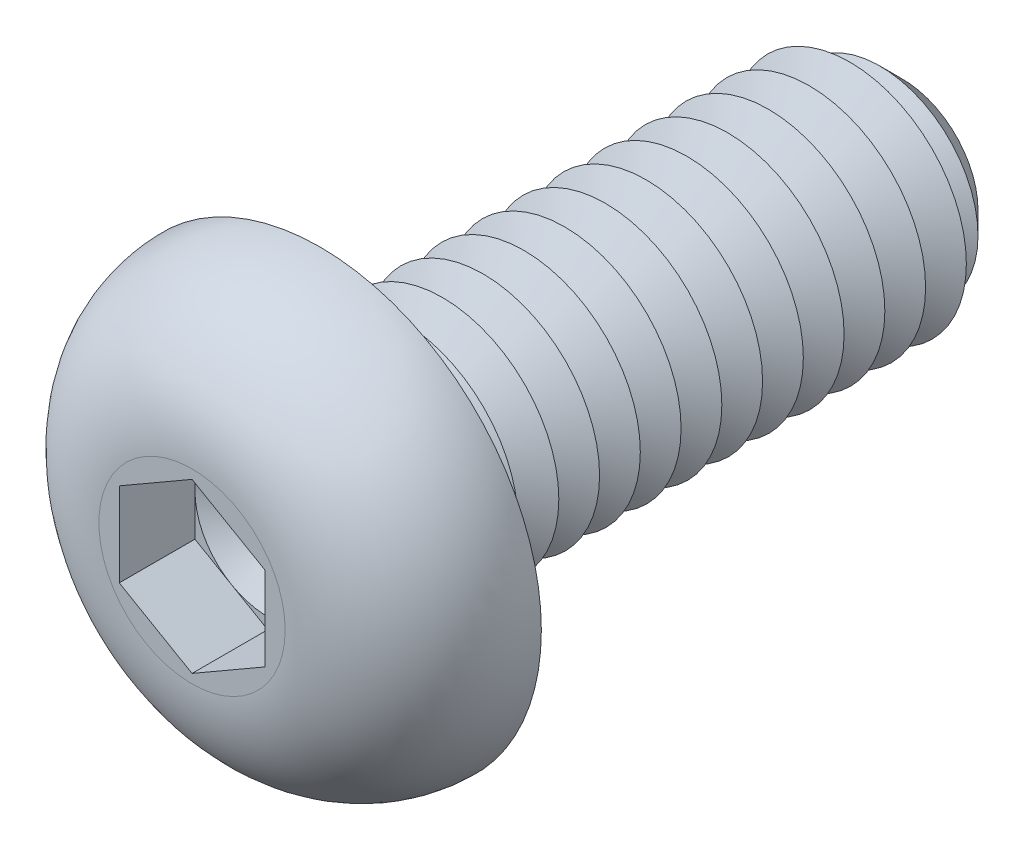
ISO-10303-21;
HEADER;
FILE_DESCRIPTION(('STEP AP214'),'2;1');
FILE_NAME('part.step','',(''),(''),'','','');
FILE_SCHEMA(('AUTOMOTIVE_DESIGN { 1 0 10303 214 1 1 1 1 }'));
ENDSEC;
DATA;
#1=APPLICATION_CONTEXT('core data for automotive mechanical design processes');
#2=APPLICATION_PROTOCOL_DEFINITION('international standard','automotive_design',2000,#1);
#3=PRODUCT_CONTEXT('',#1,'mechanical');
#4=PRODUCT('Part','Part','',(#3));
#5=PRODUCT_RELATED_PRODUCT_CATEGORY('part','',(#4));
#6=PRODUCT_DEFINITION_FORMATION('','',#4);
#7=PRODUCT_DEFINITION_CONTEXT('part definition',#1,'design');
#8=PRODUCT_DEFINITION('design','',#6,#7);
#9=PRODUCT_DEFINITION_SHAPE('','',#8);
#10=(LENGTH_UNIT() NAMED_UNIT(*) SI_UNIT(.MILLI.,.METRE.));
#11=(NAMED_UNIT(*) PLANE_ANGLE_UNIT() SI_UNIT($,.RADIAN.));
#12=(NAMED_UNIT(*) SI_UNIT($,.STERADIAN.) SOLID_ANGLE_UNIT());
#13=UNCERTAINTY_MEASURE_WITH_UNIT(LENGTH_MEASURE(1.E-05),#10,'distance_accuracy_value','');
#14=(GEOMETRIC_REPRESENTATION_CONTEXT(3) GLOBAL_UNCERTAINTY_ASSIGNED_CONTEXT((#13)) GLOBAL_UNIT_ASSIGNED_CONTEXT((#10,
#11,#12)) REPRESENTATION_CONTEXT('',''));
#15=CARTESIAN_POINT('',(0.,0.,0.));
#16=DIRECTION('',(0.,0.,1.));
#17=DIRECTION('',(1.,0.,0.));
#18=AXIS2_PLACEMENT_3D('',#15,#16,#17);
#19=CARTESIAN_POINT('',(0.,0.,0.900000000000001));
#20=DIRECTION('',(0.,0.,1.));
#21=DIRECTION('',(1.,0.,0.));
#22=AXIS2_PLACEMENT_3D('',#19,#20,#21);
#23=PLANE('',#22);
#24=CARTESIAN_POINT('',(0.,0.,0.900000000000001));
#25=DIRECTION('',(0.,0.,1.));
#26=DIRECTION('',(1.,0.,0.));
#27=AXIS2_PLACEMENT_3D('',#24,#25,#26);
#28=CIRCLE('',#27,1.25);
#29=CARTESIAN_POINT('',(1.25,0.,0.900000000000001));
#30=VERTEX_POINT('',#29);
#31=CARTESIAN_POINT('',(0.625,1.08253175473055,0.900000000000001));
#32=VERTEX_POINT('',#31);
#33=EDGE_CURVE('E117',#30,#32,#28,.T.);
#34=ORIENTED_EDGE('',*,*,#33,.F.);
#35=DIRECTION('',(0.,1.,0.));
#36=VECTOR('',#35,1.);
#37=CARTESIAN_POINT('',(1.25,-0.721687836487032,0.900000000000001));
#38=LINE('',#37,#36);
#39=CARTESIAN_POINT('',(1.25,0.721687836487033,0.900000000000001));
#40=VERTEX_POINT('',#39);
#41=EDGE_CURVE('E140',#30,#40,#38,.T.);
#42=ORIENTED_EDGE('',*,*,#41,.T.);
#43=DIRECTION('',(-0.866025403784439,0.5,0.));
#44=VECTOR('',#43,1.);
#45=CARTESIAN_POINT('',(1.25,0.721687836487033,0.900000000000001));
#46=LINE('',#45,#44);
#47=EDGE_CURVE('E135',#40,#32,#46,.T.);
#48=ORIENTED_EDGE('',*,*,#47,.T.);
#49=EDGE_LOOP('',(#34,#42,#48));
#50=FACE_BOUND('',#49,.T.);
#51=ADVANCED_FACE('F39',(#50),#23,.T.);
#52=CARTESIAN_POINT('',(0.,0.,0.900000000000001));
#53=DIRECTION('',(0.,0.,1.));
#54=DIRECTION('',(1.,0.,0.));
#55=AXIS2_PLACEMENT_3D('',#52,#53,#54);
#56=CIRCLE('',#55,1.25);
#57=CARTESIAN_POINT('',(-0.625,1.08253175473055,0.900000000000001));
#58=VERTEX_POINT('',#57);
#59=EDGE_CURVE('E11',#32,#58,#56,.T.);
#60=ORIENTED_EDGE('',*,*,#59,.F.);
#61=CARTESIAN_POINT('',(0.,1.44337567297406,0.900000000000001));
#62=VERTEX_POINT('',#61);
#63=EDGE_CURVE('E130',#32,#62,#46,.T.);
#64=ORIENTED_EDGE('',*,*,#63,.T.);
#65=DIRECTION('',(-0.866025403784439,-0.5,0.));
#66=VECTOR('',#65,1.);
#67=CARTESIAN_POINT('',(0.,1.44337567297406,0.900000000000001));
#68=LINE('',#67,#66);
#69=EDGE_CURVE('E132',#62,#58,#68,.T.);
#70=ORIENTED_EDGE('',*,*,#69,.T.);
#71=EDGE_LOOP('',(#60,#64,#70));
#72=FACE_BOUND('',#71,.T.);
#73=ADVANCED_FACE('F129',(#72),#23,.T.);
#74=CARTESIAN_POINT('',(-1.25,0.,0.900000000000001));
#75=VERTEX_POINT('',#74);
#76=EDGE_CURVE('E49',#58,#75,#56,.T.);
#77=ORIENTED_EDGE('',*,*,#76,.F.);
#78=CARTESIAN_POINT('',(-1.25,0.721687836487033,0.900000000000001));
#79=VERTEX_POINT('',#78);
#80=EDGE_CURVE('E143',#58,#79,#68,.T.);
#81=ORIENTED_EDGE('',*,*,#80,.T.);
#82=DIRECTION('',(0.,-1.,0.));
#83=VECTOR('',#82,1.);
#84=CARTESIAN_POINT('',(-1.25,0.721687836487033,0.900000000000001));
#85=LINE('',#84,#83);
#86=EDGE_CURVE('E154',#79,#75,#85,.T.);
#87=ORIENTED_EDGE('',*,*,#86,.T.);
#88=EDGE_LOOP('',(#77,#81,#87));
#89=FACE_BOUND('',#88,.T.);
#90=ADVANCED_FACE('F258',(#89),#23,.T.);
#91=CARTESIAN_POINT('',(-0.625,-1.08253175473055,0.900000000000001));
#92=VERTEX_POINT('',#91);
#93=EDGE_CURVE('E240',#75,#92,#56,.T.);
#94=ORIENTED_EDGE('',*,*,#93,.F.);
#95=CARTESIAN_POINT('',(-1.25,-0.721687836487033,0.900000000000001));
#96=VERTEX_POINT('',#95);
#97=EDGE_CURVE('E153',#75,#96,#85,.T.);
#98=ORIENTED_EDGE('',*,*,#97,.T.);
#99=DIRECTION('',(0.866025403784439,-0.5,0.));
#100=VECTOR('',#99,1.);
#101=CARTESIAN_POINT('',(-1.25,-0.721687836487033,0.900000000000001));
#102=LINE('',#101,#100);
#103=EDGE_CURVE('E159',#96,#92,#102,.T.);
#104=ORIENTED_EDGE('',*,*,#103,.T.);
#105=EDGE_LOOP('',(#94,#98,#104));
#106=FACE_BOUND('',#105,.T.);
#107=ADVANCED_FACE('F251',(#106),#23,.T.);
#108=CARTESIAN_POINT('',(0.625,-1.08253175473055,0.900000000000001));
#109=VERTEX_POINT('',#108);
#110=EDGE_CURVE('E56',#92,#109,#56,.T.);
#111=ORIENTED_EDGE('',*,*,#110,.F.);
#112=CARTESIAN_POINT('',(0.,-1.44337567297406,0.900000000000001));
#113=VERTEX_POINT('',#112);
#114=EDGE_CURVE('E158',#92,#113,#102,.T.);
#115=ORIENTED_EDGE('',*,*,#114,.T.);
#116=DIRECTION('',(0.866025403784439,0.5,0.));
#117=VECTOR('',#116,1.);
#118=CARTESIAN_POINT('',(0.,-1.44337567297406,0.900000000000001));
#119=LINE('',#118,#117);
#120=EDGE_CURVE('E164',#113,#109,#119,.T.);
#121=ORIENTED_EDGE('',*,*,#120,.T.);
#122=EDGE_LOOP('',(#111,#115,#121));
#123=FACE_BOUND('',#122,.T.);
#124=ADVANCED_FACE('F394',(#123),#23,.T.);
#125=CARTESIAN_POINT('',(0.,0.,-10.));
#126=DIRECTION('',(0.,0.,1.));
#127=DIRECTION('',(1.,0.,0.));
#128=AXIS2_PLACEMENT_3D('',#125,#126,#127);
#129=CYLINDRICAL_SURFACE('',#128,2.);
#130=CARTESIAN_POINT('',(0.,0.,-0.3));
#131=DIRECTION('',(0.,0.,1.));
#132=DIRECTION('',(1.,0.,0.));
#133=AXIS2_PLACEMENT_3D('',#130,#131,#132);
#134=CIRCLE('',#133,2.);
#135=CARTESIAN_POINT('',(2.,0.,-0.3));
#136=VERTEX_POINT('',#135);
#137=EDGE_CURVE('E221',#136,#136,#134,.F.);
#138=ORIENTED_EDGE('',*,*,#137,.T.);
#139=EDGE_LOOP('',(#138));
#140=FACE_BOUND('',#139,.T.);
#141=CARTESIAN_POINT('',(0.,0.,-0.699999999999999));
#142=DIRECTION('',(0.,0.,1.));
#143=DIRECTION('',(1.,0.,0.));
#144=AXIS2_PLACEMENT_3D('',#141,#142,#143);
#145=CIRCLE('',#144,2.);
#146=CARTESIAN_POINT('',(2.,0.,-0.699999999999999));
#147=VERTEX_POINT('',#146);
#148=EDGE_CURVE('E149',#147,#147,#145,.T.);
#149=ORIENTED_EDGE('',*,*,#148,.T.);
#150=EDGE_LOOP('',(#149));
#151=FACE_BOUND('',#150,.T.);
#152=ADVANCED_FACE('F403',(#140,#151),#129,.T.);
#153=CARTESIAN_POINT('',(0.,3.8,0.));
#154=DIRECTION('',(0.,0.,1.));
#155=DIRECTION('',(1.,0.,0.));
#156=AXIS2_PLACEMENT_3D('',#153,#154,#155);
#157=PLANE('',#156);
#158=CARTESIAN_POINT('',(0.,0.,0.));
#159=DIRECTION('',(0.,0.,1.));
#160=DIRECTION('',(1.,0.,0.));
#161=AXIS2_PLACEMENT_3D('',#158,#159,#160);
#162=CIRCLE('',#161,2.3);
#163=CARTESIAN_POINT('',(2.3,0.,0.));
#164=VERTEX_POINT('',#163);
#165=EDGE_CURVE('E230',#164,#164,#162,.T.);
#166=ORIENTED_EDGE('',*,*,#165,.T.);
#167=EDGE_LOOP('',(#166));
#168=FACE_BOUND('',#167,.T.);
#169=CARTESIAN_POINT('',(0.,0.,0.));
#170=DIRECTION('',(0.,0.,1.));
#171=DIRECTION('',(1.,0.,0.));
#172=AXIS2_PLACEMENT_3D('',#169,#170,#171);
#173=CIRCLE('',#172,3.8);
#174=CARTESIAN_POINT('',(3.8,0.,0.));
#175=VERTEX_POINT('',#174);
#176=EDGE_CURVE('E196',#175,#175,#173,.T.);
#177=ORIENTED_EDGE('',*,*,#176,.F.);
#178=EDGE_LOOP('',(#177));
#179=FACE_BOUND('',#178,.T.);
#180=ADVANCED_FACE('F408',(#168,#179),#157,.F.);
#181=CARTESIAN_POINT('',(0.,0.,2.2));
#182=DIRECTION('',(0.,0.,-1.));
#183=DIRECTION('',(-1.,0.,0.));
#184=AXIS2_PLACEMENT_3D('',#181,#182,#183);
#185=PLANE('',#184);
#186=DIRECTION('',(-0.866025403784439,-0.5,0.));
#187=VECTOR('',#186,1.);
#188=CARTESIAN_POINT('',(0.,1.44337567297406,2.2));
#189=LINE('',#188,#187);
#190=CARTESIAN_POINT('',(0.,1.44337567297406,2.2));
#191=VERTEX_POINT('',#190);
#192=CARTESIAN_POINT('',(-1.25,0.721687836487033,2.2));
#193=VERTEX_POINT('',#192);
#194=EDGE_CURVE('E174',#191,#193,#189,.T.);
#195=ORIENTED_EDGE('',*,*,#194,.F.);
#196=DIRECTION('',(-0.866025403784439,0.5,0.));
#197=VECTOR('',#196,1.);
#198=CARTESIAN_POINT('',(1.25,0.721687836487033,2.2));
#199=LINE('',#198,#197);
#200=CARTESIAN_POINT('',(1.25,0.721687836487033,2.2));
#201=VERTEX_POINT('',#200);
#202=EDGE_CURVE('E64',#201,#191,#199,.T.);
#203=ORIENTED_EDGE('',*,*,#202,.F.);
#204=DIRECTION('',(0.,1.,0.));
#205=VECTOR('',#204,1.);
#206=CARTESIAN_POINT('',(1.25,-0.721687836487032,2.2));
#207=LINE('',#206,#205);
#208=CARTESIAN_POINT('',(1.25,-0.721687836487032,2.2));
#209=VERTEX_POINT('',#208);
#210=EDGE_CURVE('E138',#209,#201,#207,.T.);
#211=ORIENTED_EDGE('',*,*,#210,.F.);
#212=DIRECTION('',(0.866025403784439,0.5,0.));
#213=VECTOR('',#212,1.);
#214=CARTESIAN_POINT('',(0.,-1.44337567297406,2.2));
#215=LINE('',#214,#213);
#216=CARTESIAN_POINT('',(0.,-1.44337567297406,2.2));
#217=VERTEX_POINT('',#216);
#218=EDGE_CURVE('E186',#217,#209,#215,.T.);
#219=ORIENTED_EDGE('',*,*,#218,.F.);
#220=DIRECTION('',(0.866025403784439,-0.5,0.));
#221=VECTOR('',#220,1.);
#222=CARTESIAN_POINT('',(-1.25,-0.721687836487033,2.2));
#223=LINE('',#222,#221);
#224=CARTESIAN_POINT('',(-1.25,-0.721687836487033,2.2));
#225=VERTEX_POINT('',#224);
#226=EDGE_CURVE('E182',#225,#217,#223,.T.);
#227=ORIENTED_EDGE('',*,*,#226,.F.);
#228=DIRECTION('',(0.,-1.,0.));
#229=VECTOR('',#228,1.);
#230=CARTESIAN_POINT('',(-1.25,0.721687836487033,2.2));
#231=LINE('',#230,#229);
#232=EDGE_CURVE('E178',#193,#225,#231,.T.);
#233=ORIENTED_EDGE('',*,*,#232,.F.);
#234=EDGE_LOOP('',(#195,#203,#211,#219,#227,#233));
#235=FACE_BOUND('',#234,.T.);
#236=CARTESIAN_POINT('',(0.,0.,2.2));
#237=DIRECTION('',(0.,0.,1.));
#238=DIRECTION('',(1.,0.,0.));
#239=AXIS2_PLACEMENT_3D('',#236,#237,#238);
#240=CIRCLE('',#239,1.6);
#241=CARTESIAN_POINT('',(1.6,0.,2.2));
#242=VERTEX_POINT('',#241);
#243=EDGE_CURVE('E213',#242,#242,#240,.T.);
#244=ORIENTED_EDGE('',*,*,#243,.T.);
#245=EDGE_LOOP('',(#244));
#246=FACE_BOUND('',#245,.T.);
#247=ADVANCED_FACE('F267',(#235,#246),#185,.F.);
#248=CARTESIAN_POINT('',(0.,0.,0.));
#249=DIRECTION('',(0.,0.,1.));
#250=DIRECTION('',(1.,0.,0.));
#251=AXIS2_PLACEMENT_3D('',#248,#249,#250);
#252=DEGENERATE_TOROIDAL_SURFACE('',#251,1.6,2.2,.T.);
#253=ORIENTED_EDGE('',*,*,#243,.F.);
#254=EDGE_LOOP('',(#253));
#255=FACE_BOUND('',#254,.T.);
#256=ORIENTED_EDGE('',*,*,#176,.T.);
#257=EDGE_LOOP('',(#256));
#258=FACE_BOUND('',#257,.T.);
#259=ADVANCED_FACE('F424',(#255,#258),#252,.T.);
#260=CARTESIAN_POINT('',(1.25,0.721687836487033,0.900000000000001));
#261=DIRECTION('',(0.5,0.866025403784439,0.));
#262=DIRECTION('',(-0.866025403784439,0.5,0.));
#263=AXIS2_PLACEMENT_3D('',#260,#261,#262);
#264=PLANE('',#263);
#265=ORIENTED_EDGE('',*,*,#202,.T.);
#266=DIRECTION('',(0.,0.,1.));
#267=VECTOR('',#266,1.);
#268=CARTESIAN_POINT('',(0.,1.44337567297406,0.900000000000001));
#269=LINE('',#268,#267);
#270=EDGE_CURVE('E136',#62,#191,#269,.T.);
#271=ORIENTED_EDGE('',*,*,#270,.F.);
#272=ORIENTED_EDGE('',*,*,#63,.F.);
#273=ORIENTED_EDGE('',*,*,#47,.F.);
#274=DIRECTION('',(0.,0.,1.));
#275=VECTOR('',#274,1.);
#276=CARTESIAN_POINT('',(1.25,0.721687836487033,0.900000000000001));
#277=LINE('',#276,#275);
#278=EDGE_CURVE('E193',#40,#201,#277,.T.);
#279=ORIENTED_EDGE('',*,*,#278,.T.);
#280=EDGE_LOOP('',(#265,#271,#272,#273,#279));
#281=FACE_BOUND('',#280,.T.);
#282=ADVANCED_FACE('F134',(#281),#264,.F.);
#283=CARTESIAN_POINT('',(1.25,-0.721687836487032,0.900000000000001));
#284=DIRECTION('',(1.,0.,0.));
#285=DIRECTION('',(0.,1.,0.));
#286=AXIS2_PLACEMENT_3D('',#283,#284,#285);
#287=PLANE('',#286);
#288=ORIENTED_EDGE('',*,*,#210,.T.);
#289=ORIENTED_EDGE('',*,*,#278,.F.);
#290=ORIENTED_EDGE('',*,*,#41,.F.);
#291=CARTESIAN_POINT('',(1.25,-0.721687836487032,0.900000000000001));
#292=VERTEX_POINT('',#291);
#293=EDGE_CURVE('E168',#292,#30,#38,.T.);
#294=ORIENTED_EDGE('',*,*,#293,.F.);
#295=DIRECTION('',(0.,0.,1.));
#296=VECTOR('',#295,1.);
#297=CARTESIAN_POINT('',(1.25,-0.721687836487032,0.900000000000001));
#298=LINE('',#297,#296);
#299=EDGE_CURVE('E197',#292,#209,#298,.T.);
#300=ORIENTED_EDGE('',*,*,#299,.T.);
#301=EDGE_LOOP('',(#288,#289,#290,#294,#300));
#302=FACE_BOUND('',#301,.T.);
#303=ADVANCED_FACE('F417',(#302),#287,.F.);
#304=CARTESIAN_POINT('',(0.,-1.44337567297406,0.900000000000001));
#305=DIRECTION('',(0.5,-0.866025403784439,0.));
#306=DIRECTION('',(0.866025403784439,0.5,0.));
#307=AXIS2_PLACEMENT_3D('',#304,#305,#306);
#308=PLANE('',#307);
#309=ORIENTED_EDGE('',*,*,#218,.T.);
#310=ORIENTED_EDGE('',*,*,#299,.F.);
#311=EDGE_CURVE('E163',#109,#292,#119,.T.);
#312=ORIENTED_EDGE('',*,*,#311,.F.);
#313=ORIENTED_EDGE('',*,*,#120,.F.);
#314=DIRECTION('',(0.,0.,1.));
#315=VECTOR('',#314,1.);
#316=CARTESIAN_POINT('',(0.,-1.44337567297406,0.900000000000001));
#317=LINE('',#316,#315);
#318=EDGE_CURVE('E200',#113,#217,#317,.T.);
#319=ORIENTED_EDGE('',*,*,#318,.T.);
#320=EDGE_LOOP('',(#309,#310,#312,#313,#319));
#321=FACE_BOUND('',#320,.T.);
#322=ADVANCED_FACE('F412',(#321),#308,.F.);
#323=CARTESIAN_POINT('',(-1.25,-0.721687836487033,0.900000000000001));
#324=DIRECTION('',(-0.5,-0.866025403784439,0.));
#325=DIRECTION('',(0.866025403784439,-0.5,0.));
#326=AXIS2_PLACEMENT_3D('',#323,#324,#325);
#327=PLANE('',#326);
#328=ORIENTED_EDGE('',*,*,#226,.T.);
#329=ORIENTED_EDGE('',*,*,#318,.F.);
#330=ORIENTED_EDGE('',*,*,#114,.F.);
#331=ORIENTED_EDGE('',*,*,#103,.F.);
#332=DIRECTION('',(0.,0.,1.));
#333=VECTOR('',#332,1.);
#334=CARTESIAN_POINT('',(-1.25,-0.721687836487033,0.900000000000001));
#335=LINE('',#334,#333);
#336=EDGE_CURVE('E203',#96,#225,#335,.T.);
#337=ORIENTED_EDGE('',*,*,#336,.T.);
#338=EDGE_LOOP('',(#328,#329,#330,#331,#337));
#339=FACE_BOUND('',#338,.T.);
#340=ADVANCED_FACE('F272',(#339),#327,.F.);
#341=CARTESIAN_POINT('',(-1.25,0.721687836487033,0.900000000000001));
#342=DIRECTION('',(-1.,0.,0.));
#343=DIRECTION('',(0.,0.,1.));
#344=AXIS2_PLACEMENT_3D('',#341,#342,#343);
#345=PLANE('',#344);
#346=ORIENTED_EDGE('',*,*,#232,.T.);
#347=ORIENTED_EDGE('',*,*,#336,.F.);
#348=ORIENTED_EDGE('',*,*,#97,.F.);
#349=ORIENTED_EDGE('',*,*,#86,.F.);
#350=DIRECTION('',(0.,0.,1.));
#351=VECTOR('',#350,1.);
#352=CARTESIAN_POINT('',(-1.25,0.721687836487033,0.900000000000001));
#353=LINE('',#352,#351);
#354=EDGE_CURVE('E205',#79,#193,#353,.T.);
#355=ORIENTED_EDGE('',*,*,#354,.T.);
#356=EDGE_LOOP('',(#346,#347,#348,#349,#355));
#357=FACE_BOUND('',#356,.T.);
#358=ADVANCED_FACE('F256',(#357),#345,.F.);
#359=CARTESIAN_POINT('',(0.,1.44337567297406,0.900000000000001));
#360=DIRECTION('',(-0.5,0.866025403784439,0.));
#361=DIRECTION('',(-0.866025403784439,-0.5,0.));
#362=AXIS2_PLACEMENT_3D('',#359,#360,#361);
#363=PLANE('',#362);
#364=ORIENTED_EDGE('',*,*,#194,.T.);
#365=ORIENTED_EDGE('',*,*,#354,.F.);
#366=ORIENTED_EDGE('',*,*,#80,.F.);
#367=ORIENTED_EDGE('',*,*,#69,.F.);
#368=ORIENTED_EDGE('',*,*,#270,.T.);
#369=EDGE_LOOP('',(#364,#365,#366,#367,#368));
#370=FACE_BOUND('',#369,.T.);
#371=ADVANCED_FACE('F261',(#370),#363,.F.);
#372=EDGE_CURVE('E43',#109,#30,#56,.T.);
#373=ORIENTED_EDGE('',*,*,#372,.F.);
#374=ORIENTED_EDGE('',*,*,#311,.T.);
#375=ORIENTED_EDGE('',*,*,#293,.T.);
#376=EDGE_LOOP('',(#373,#374,#375));
#377=FACE_BOUND('',#376,.T.);
#378=ADVANCED_FACE('F386',(#377),#23,.T.);
#379=CARTESIAN_POINT('',(0.,0.,-0.699999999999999));
#380=DIRECTION('',(0.,0.,1.));
#381=DIRECTION('',(1.,0.,0.));
#382=AXIS2_PLACEMENT_3D('',#379,#380,#381);
#383=CONICAL_SURFACE('',#382,2.,1.04719755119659);
#384=CARTESIAN_POINT('',(0.,0.,-1.05));
#385=DIRECTION('',(0.,0.,1.));
#386=DIRECTION('',(1.,0.,0.));
#387=AXIS2_PLACEMENT_3D('',#384,#385,#386);
#388=CIRCLE('',#387,1.3937822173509);
#389=CARTESIAN_POINT('',(1.3937822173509,0.,-1.05));
#390=VERTEX_POINT('',#389);
#391=EDGE_CURVE('E300',#390,#390,#388,.T.);
#392=ORIENTED_EDGE('',*,*,#391,.T.);
#393=EDGE_LOOP('',(#392));
#394=FACE_BOUND('',#393,.T.);
#395=ORIENTED_EDGE('',*,*,#148,.F.);
#396=EDGE_LOOP('',(#395));
#397=FACE_BOUND('',#396,.T.);
#398=ADVANCED_FACE('F382',(#394,#397),#383,.T.);
#399=CARTESIAN_POINT('',(0.,0.,-1.05));
#400=DIRECTION('',(0.,0.,-1.));
#401=DIRECTION('',(-1.,0.,0.));
#402=AXIS2_PLACEMENT_3D('',#399,#400,#401);
#403=CONICAL_SURFACE('',#402,1.3937822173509,1.0471975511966);
#404=CARTESIAN_POINT('',(0.,0.,-1.4));
#405=DIRECTION('',(0.,0.,1.));
#406=DIRECTION('',(1.,0.,0.));
#407=AXIS2_PLACEMENT_3D('',#404,#405,#406);
#408=CIRCLE('',#407,2.);
#409=CARTESIAN_POINT('',(2.,0.,-1.4));
#410=VERTEX_POINT('',#409);
#411=EDGE_CURVE('E302',#410,#410,#408,.T.);
#412=ORIENTED_EDGE('',*,*,#411,.T.);
#413=EDGE_LOOP('',(#412));
#414=FACE_BOUND('',#413,.T.);
#415=ORIENTED_EDGE('',*,*,#391,.F.);
#416=EDGE_LOOP('',(#415));
#417=FACE_BOUND('',#416,.T.);
#418=ADVANCED_FACE('F367',(#414,#417),#403,.T.);
#419=CARTESIAN_POINT('',(0.,0.,-1.4));
#420=DIRECTION('',(0.,0.,1.));
#421=DIRECTION('',(1.,0.,0.));
#422=AXIS2_PLACEMENT_3D('',#419,#420,#421);
#423=CONICAL_SURFACE('',#422,2.,1.04719755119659);
#424=CARTESIAN_POINT('',(0.,0.,-1.75));
#425=DIRECTION('',(0.,0.,1.));
#426=DIRECTION('',(1.,0.,0.));
#427=AXIS2_PLACEMENT_3D('',#424,#425,#426);
#428=CIRCLE('',#427,1.3937822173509);
#429=CARTESIAN_POINT('',(1.3937822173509,0.,-1.75));
#430=VERTEX_POINT('',#429);
#431=EDGE_CURVE('E314',#430,#430,#428,.T.);
#432=ORIENTED_EDGE('',*,*,#431,.T.);
#433=EDGE_LOOP('',(#432));
#434=FACE_BOUND('',#433,.T.);
#435=ORIENTED_EDGE('',*,*,#411,.F.);
#436=EDGE_LOOP('',(#435));
#437=FACE_BOUND('',#436,.T.);
#438=ADVANCED_FACE('F370',(#434,#437),#423,.T.);
#439=CARTESIAN_POINT('',(0.,0.,-1.75));
#440=DIRECTION('',(0.,0.,-1.));
#441=DIRECTION('',(-1.,0.,0.));
#442=AXIS2_PLACEMENT_3D('',#439,#440,#441);
#443=CONICAL_SURFACE('',#442,1.3937822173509,1.0471975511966);
#444=CARTESIAN_POINT('',(0.,0.,-2.1));
#445=DIRECTION('',(0.,0.,1.));
#446=DIRECTION('',(1.,0.,0.));
#447=AXIS2_PLACEMENT_3D('',#444,#445,#446);
#448=CIRCLE('',#447,2.);
#449=CARTESIAN_POINT('',(2.,0.,-2.1));
#450=VERTEX_POINT('',#449);
#451=EDGE_CURVE('E312',#450,#450,#448,.T.);
#452=ORIENTED_EDGE('',*,*,#451,.T.);
#453=EDGE_LOOP('',(#452));
#454=FACE_BOUND('',#453,.T.);
#455=ORIENTED_EDGE('',*,*,#431,.F.);
#456=EDGE_LOOP('',(#455));
#457=FACE_BOUND('',#456,.T.);
#458=ADVANCED_FACE('F372',(#454,#457),#443,.T.);
#459=CARTESIAN_POINT('',(0.,0.,-2.1));
#460=DIRECTION('',(0.,0.,1.));
#461=DIRECTION('',(1.,0.,0.));
#462=AXIS2_PLACEMENT_3D('',#459,#460,#461);
#463=CONICAL_SURFACE('',#462,2.,1.04719755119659);
#464=CARTESIAN_POINT('',(0.,0.,-2.45));
#465=DIRECTION('',(0.,0.,1.));
#466=DIRECTION('',(1.,0.,0.));
#467=AXIS2_PLACEMENT_3D('',#464,#465,#466);
#468=CIRCLE('',#467,1.3937822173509);
#469=CARTESIAN_POINT('',(1.3937822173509,0.,-2.45));
#470=VERTEX_POINT('',#469);
#471=EDGE_CURVE('E315',#470,#470,#468,.T.);
#472=ORIENTED_EDGE('',*,*,#471,.T.);
#473=EDGE_LOOP('',(#472));
#474=FACE_BOUND('',#473,.T.);
#475=ORIENTED_EDGE('',*,*,#451,.F.);
#476=EDGE_LOOP('',(#475));
#477=FACE_BOUND('',#476,.T.);
#478=ADVANCED_FACE('F379',(#474,#477),#463,.T.);
#479=CARTESIAN_POINT('',(0.,0.,-2.45));
#480=DIRECTION('',(0.,0.,-1.));
#481=DIRECTION('',(-1.,0.,0.));
#482=AXIS2_PLACEMENT_3D('',#479,#480,#481);
#483=CONICAL_SURFACE('',#482,1.3937822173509,1.0471975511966);
#484=CARTESIAN_POINT('',(0.,0.,-2.8));
#485=DIRECTION('',(0.,0.,1.));
#486=DIRECTION('',(1.,0.,0.));
#487=AXIS2_PLACEMENT_3D('',#484,#485,#486);
#488=CIRCLE('',#487,2.);
#489=CARTESIAN_POINT('',(2.,0.,-2.8));
#490=VERTEX_POINT('',#489);
#491=EDGE_CURVE('E354',#490,#490,#488,.T.);
#492=ORIENTED_EDGE('',*,*,#491,.T.);
#493=EDGE_LOOP('',(#492));
#494=FACE_BOUND('',#493,.T.);
#495=ORIENTED_EDGE('',*,*,#471,.F.);
#496=EDGE_LOOP('',(#495));
#497=FACE_BOUND('',#496,.T.);
#498=ADVANCED_FACE('F543',(#494,#497),#483,.T.);
#499=CARTESIAN_POINT('',(0.,0.,-2.8));
#500=DIRECTION('',(0.,0.,1.));
#501=DIRECTION('',(1.,0.,0.));
#502=AXIS2_PLACEMENT_3D('',#499,#500,#501);
#503=CONICAL_SURFACE('',#502,2.,1.04719755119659);
#504=CARTESIAN_POINT('',(0.,0.,-3.15));
#505=DIRECTION('',(0.,0.,1.));
#506=DIRECTION('',(1.,0.,0.));
#507=AXIS2_PLACEMENT_3D('',#504,#505,#506);
#508=CIRCLE('',#507,1.3937822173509);
#509=CARTESIAN_POINT('',(1.3937822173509,0.,-3.15));
#510=VERTEX_POINT('',#509);
#511=EDGE_CURVE('E350',#510,#510,#508,.T.);
#512=ORIENTED_EDGE('',*,*,#511,.T.);
#513=EDGE_LOOP('',(#512));
#514=FACE_BOUND('',#513,.T.);
#515=ORIENTED_EDGE('',*,*,#491,.F.);
#516=EDGE_LOOP('',(#515));
#517=FACE_BOUND('',#516,.T.);
#518=ADVANCED_FACE('F539',(#514,#517),#503,.T.);
#519=CARTESIAN_POINT('',(0.,0.,-3.15));
#520=DIRECTION('',(0.,0.,-1.));
#521=DIRECTION('',(-1.,0.,0.));
#522=AXIS2_PLACEMENT_3D('',#519,#520,#521);
#523=CONICAL_SURFACE('',#522,1.3937822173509,1.0471975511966);
#524=CARTESIAN_POINT('',(0.,0.,-3.5));
#525=DIRECTION('',(0.,0.,1.));
#526=DIRECTION('',(1.,0.,0.));
#527=AXIS2_PLACEMENT_3D('',#524,#525,#526);
#528=CIRCLE('',#527,2.);
#529=CARTESIAN_POINT('',(2.,0.,-3.5));
#530=VERTEX_POINT('',#529);
#531=EDGE_CURVE('E298',#530,#530,#528,.T.);
#532=ORIENTED_EDGE('',*,*,#531,.T.);
#533=EDGE_LOOP('',(#532));
#534=FACE_BOUND('',#533,.T.);
#535=ORIENTED_EDGE('',*,*,#511,.F.);
#536=EDGE_LOOP('',(#535));
#537=FACE_BOUND('',#536,.T.);
#538=ADVANCED_FACE('F535',(#534,#537),#523,.T.);
#539=CARTESIAN_POINT('',(0.,0.,-3.5));
#540=DIRECTION('',(0.,0.,1.));
#541=DIRECTION('',(1.,0.,0.));
#542=AXIS2_PLACEMENT_3D('',#539,#540,#541);
#543=CONICAL_SURFACE('',#542,2.,1.04719755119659);
#544=CARTESIAN_POINT('',(0.,0.,-3.85));
#545=DIRECTION('',(0.,0.,1.));
#546=DIRECTION('',(1.,0.,0.));
#547=AXIS2_PLACEMENT_3D('',#544,#545,#546);
#548=CIRCLE('',#547,1.3937822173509);
#549=CARTESIAN_POINT('',(1.3937822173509,0.,-3.85));
#550=VERTEX_POINT('',#549);
#551=EDGE_CURVE('E288',#550,#550,#548,.T.);
#552=ORIENTED_EDGE('',*,*,#551,.T.);
#553=EDGE_LOOP('',(#552));
#554=FACE_BOUND('',#553,.T.);
#555=ORIENTED_EDGE('',*,*,#531,.F.);
#556=EDGE_LOOP('',(#555));
#557=FACE_BOUND('',#556,.T.);
#558=ADVANCED_FACE('F531',(#554,#557),#543,.T.);
#559=CARTESIAN_POINT('',(0.,0.,-3.85));
#560=DIRECTION('',(0.,0.,-1.));
#561=DIRECTION('',(-1.,0.,0.));
#562=AXIS2_PLACEMENT_3D('',#559,#560,#561);
#563=CONICAL_SURFACE('',#562,1.3937822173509,1.0471975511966);
#564=CARTESIAN_POINT('',(0.,0.,-4.2));
#565=DIRECTION('',(0.,0.,1.));
#566=DIRECTION('',(1.,0.,0.));
#567=AXIS2_PLACEMENT_3D('',#564,#565,#566);
#568=CIRCLE('',#567,2.);
#569=CARTESIAN_POINT('',(2.,0.,-4.2));
#570=VERTEX_POINT('',#569);
#571=EDGE_CURVE('E284',#570,#570,#568,.T.);
#572=ORIENTED_EDGE('',*,*,#571,.T.);
#573=EDGE_LOOP('',(#572));
#574=FACE_BOUND('',#573,.T.);
#575=ORIENTED_EDGE('',*,*,#551,.F.);
#576=EDGE_LOOP('',(#575));
#577=FACE_BOUND('',#576,.T.);
#578=ADVANCED_FACE('F527',(#574,#577),#563,.T.);
#579=CARTESIAN_POINT('',(0.,0.,-4.2));
#580=DIRECTION('',(0.,0.,1.));
#581=DIRECTION('',(1.,0.,0.));
#582=AXIS2_PLACEMENT_3D('',#579,#580,#581);
#583=CONICAL_SURFACE('',#582,2.,1.04719755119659);
#584=CARTESIAN_POINT('',(0.,0.,-4.55));
#585=DIRECTION('',(0.,0.,1.));
#586=DIRECTION('',(1.,0.,0.));
#587=AXIS2_PLACEMENT_3D('',#584,#585,#586);
#588=CIRCLE('',#587,1.3937822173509);
#589=CARTESIAN_POINT('',(1.3937822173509,0.,-4.55));
#590=VERTEX_POINT('',#589);
#591=EDGE_CURVE('E281',#590,#590,#588,.T.);
#592=ORIENTED_EDGE('',*,*,#591,.T.);
#593=EDGE_LOOP('',(#592));
#594=FACE_BOUND('',#593,.T.);
#595=ORIENTED_EDGE('',*,*,#571,.F.);
#596=EDGE_LOOP('',(#595));
#597=FACE_BOUND('',#596,.T.);
#598=ADVANCED_FACE('F523',(#594,#597),#583,.T.);
#599=CARTESIAN_POINT('',(0.,0.,-4.55));
#600=DIRECTION('',(0.,0.,-1.));
#601=DIRECTION('',(-1.,0.,0.));
#602=AXIS2_PLACEMENT_3D('',#599,#600,#601);
#603=CONICAL_SURFACE('',#602,1.3937822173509,1.0471975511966);
#604=CARTESIAN_POINT('',(0.,0.,-4.9));
#605=DIRECTION('',(0.,0.,1.));
#606=DIRECTION('',(1.,0.,0.));
#607=AXIS2_PLACEMENT_3D('',#604,#605,#606);
#608=CIRCLE('',#607,2.);
#609=CARTESIAN_POINT('',(2.,0.,-4.9));
#610=VERTEX_POINT('',#609);
#611=EDGE_CURVE('E285',#610,#610,#608,.T.);
#612=ORIENTED_EDGE('',*,*,#611,.T.);
#613=EDGE_LOOP('',(#612));
#614=FACE_BOUND('',#613,.T.);
#615=ORIENTED_EDGE('',*,*,#591,.F.);
#616=EDGE_LOOP('',(#615));
#617=FACE_BOUND('',#616,.T.);
#618=ADVANCED_FACE('F519',(#614,#617),#603,.T.);
#619=CARTESIAN_POINT('',(0.,0.,-4.9));
#620=DIRECTION('',(0.,0.,1.));
#621=DIRECTION('',(1.,0.,0.));
#622=AXIS2_PLACEMENT_3D('',#619,#620,#621);
#623=CONICAL_SURFACE('',#622,2.,1.04719755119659);
#624=CARTESIAN_POINT('',(0.,0.,-5.25));
#625=DIRECTION('',(0.,0.,1.));
#626=DIRECTION('',(1.,0.,0.));
#627=AXIS2_PLACEMENT_3D('',#624,#625,#626);
#628=CIRCLE('',#627,1.3937822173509);
#629=CARTESIAN_POINT('',(1.3937822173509,0.,-5.25));
#630=VERTEX_POINT('',#629);
#631=EDGE_CURVE('E342',#630,#630,#628,.T.);
#632=ORIENTED_EDGE('',*,*,#631,.T.);
#633=EDGE_LOOP('',(#632));
#634=FACE_BOUND('',#633,.T.);
#635=ORIENTED_EDGE('',*,*,#611,.F.);
#636=EDGE_LOOP('',(#635));
#637=FACE_BOUND('',#636,.T.);
#638=ADVANCED_FACE('F515',(#634,#637),#623,.T.);
#639=CARTESIAN_POINT('',(0.,0.,-5.25));
#640=DIRECTION('',(0.,0.,-1.));
#641=DIRECTION('',(-1.,0.,0.));
#642=AXIS2_PLACEMENT_3D('',#639,#640,#641);
#643=CONICAL_SURFACE('',#642,1.3937822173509,1.0471975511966);
#644=CARTESIAN_POINT('',(0.,0.,-5.6));
#645=DIRECTION('',(0.,0.,1.));
#646=DIRECTION('',(1.,0.,0.));
#647=AXIS2_PLACEMENT_3D('',#644,#645,#646);
#648=CIRCLE('',#647,2.);
#649=CARTESIAN_POINT('',(2.,0.,-5.6));
#650=VERTEX_POINT('',#649);
#651=EDGE_CURVE('E338',#650,#650,#648,.T.);
#652=ORIENTED_EDGE('',*,*,#651,.T.);
#653=EDGE_LOOP('',(#652));
#654=FACE_BOUND('',#653,.T.);
#655=ORIENTED_EDGE('',*,*,#631,.F.);
#656=EDGE_LOOP('',(#655));
#657=FACE_BOUND('',#656,.T.);
#658=ADVANCED_FACE('F511',(#654,#657),#643,.T.);
#659=CARTESIAN_POINT('',(0.,0.,-5.6));
#660=DIRECTION('',(0.,0.,1.));
#661=DIRECTION('',(1.,0.,0.));
#662=AXIS2_PLACEMENT_3D('',#659,#660,#661);
#663=CONICAL_SURFACE('',#662,2.,1.04719755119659);
#664=CARTESIAN_POINT('',(0.,0.,-5.95));
#665=DIRECTION('',(0.,0.,1.));
#666=DIRECTION('',(1.,0.,0.));
#667=AXIS2_PLACEMENT_3D('',#664,#665,#666);
#668=CIRCLE('',#667,1.3937822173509);
#669=CARTESIAN_POINT('',(1.3937822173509,0.,-5.95));
#670=VERTEX_POINT('',#669);
#671=EDGE_CURVE('E335',#670,#670,#668,.T.);
#672=ORIENTED_EDGE('',*,*,#671,.T.);
#673=EDGE_LOOP('',(#672));
#674=FACE_BOUND('',#673,.T.);
#675=ORIENTED_EDGE('',*,*,#651,.F.);
#676=EDGE_LOOP('',(#675));
#677=FACE_BOUND('',#676,.T.);
#678=ADVANCED_FACE('F507',(#674,#677),#663,.T.);
#679=CARTESIAN_POINT('',(0.,0.,-5.95));
#680=DIRECTION('',(0.,0.,-1.));
#681=DIRECTION('',(-1.,0.,0.));
#682=AXIS2_PLACEMENT_3D('',#679,#680,#681);
#683=CONICAL_SURFACE('',#682,1.3937822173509,1.0471975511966);
#684=CARTESIAN_POINT('',(0.,0.,-6.3));
#685=DIRECTION('',(0.,0.,1.));
#686=DIRECTION('',(1.,0.,0.));
#687=AXIS2_PLACEMENT_3D('',#684,#685,#686);
#688=CIRCLE('',#687,2.);
#689=CARTESIAN_POINT('',(2.,0.,-6.3));
#690=VERTEX_POINT('',#689);
#691=EDGE_CURVE('E279',#690,#690,#688,.T.);
#692=ORIENTED_EDGE('',*,*,#691,.T.);
#693=EDGE_LOOP('',(#692));
#694=FACE_BOUND('',#693,.T.);
#695=ORIENTED_EDGE('',*,*,#671,.F.);
#696=EDGE_LOOP('',(#695));
#697=FACE_BOUND('',#696,.T.);
#698=ADVANCED_FACE('F503',(#694,#697),#683,.T.);
#699=CARTESIAN_POINT('',(0.,0.,-6.3));
#700=DIRECTION('',(0.,0.,1.));
#701=DIRECTION('',(1.,0.,0.));
#702=AXIS2_PLACEMENT_3D('',#699,#700,#701);
#703=CONICAL_SURFACE('',#702,2.,1.04719755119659);
#704=CARTESIAN_POINT('',(0.,0.,-6.65));
#705=DIRECTION('',(0.,0.,1.));
#706=DIRECTION('',(1.,0.,0.));
#707=AXIS2_PLACEMENT_3D('',#704,#705,#706);
#708=CIRCLE('',#707,1.3937822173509);
#709=CARTESIAN_POINT('',(1.3937822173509,0.,-6.65));
#710=VERTEX_POINT('',#709);
#711=EDGE_CURVE('E329',#710,#710,#708,.T.);
#712=ORIENTED_EDGE('',*,*,#711,.T.);
#713=EDGE_LOOP('',(#712));
#714=FACE_BOUND('',#713,.T.);
#715=ORIENTED_EDGE('',*,*,#691,.F.);
#716=EDGE_LOOP('',(#715));
#717=FACE_BOUND('',#716,.T.);
#718=ADVANCED_FACE('F499',(#714,#717),#703,.T.);
#719=CARTESIAN_POINT('',(0.,0.,-6.65));
#720=DIRECTION('',(0.,0.,-1.));
#721=DIRECTION('',(-1.,0.,0.));
#722=AXIS2_PLACEMENT_3D('',#719,#720,#721);
#723=CONICAL_SURFACE('',#722,1.3937822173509,1.0471975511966);
#724=CARTESIAN_POINT('',(0.,0.,-7.));
#725=DIRECTION('',(0.,0.,1.));
#726=DIRECTION('',(1.,0.,0.));
#727=AXIS2_PLACEMENT_3D('',#724,#725,#726);
#728=CIRCLE('',#727,2.);
#729=CARTESIAN_POINT('',(2.,0.,-7.));
#730=VERTEX_POINT('',#729);
#731=EDGE_CURVE('E326',#730,#730,#728,.T.);
#732=ORIENTED_EDGE('',*,*,#731,.T.);
#733=EDGE_LOOP('',(#732));
#734=FACE_BOUND('',#733,.T.);
#735=ORIENTED_EDGE('',*,*,#711,.F.);
#736=EDGE_LOOP('',(#735));
#737=FACE_BOUND('',#736,.T.);
#738=ADVANCED_FACE('F495',(#734,#737),#723,.T.);
#739=CARTESIAN_POINT('',(0.,0.,-7.));
#740=DIRECTION('',(0.,0.,1.));
#741=DIRECTION('',(1.,0.,0.));
#742=AXIS2_PLACEMENT_3D('',#739,#740,#741);
#743=CONICAL_SURFACE('',#742,2.,1.04719755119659);
#744=CARTESIAN_POINT('',(0.,0.,-7.35));
#745=DIRECTION('',(0.,0.,1.));
#746=DIRECTION('',(1.,0.,0.));
#747=AXIS2_PLACEMENT_3D('',#744,#745,#746);
#748=CIRCLE('',#747,1.3937822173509);
#749=CARTESIAN_POINT('',(1.3937822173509,0.,-7.35));
#750=VERTEX_POINT('',#749);
#751=EDGE_CURVE('E310',#750,#750,#748,.T.);
#752=ORIENTED_EDGE('',*,*,#751,.T.);
#753=EDGE_LOOP('',(#752));
#754=FACE_BOUND('',#753,.T.);
#755=ORIENTED_EDGE('',*,*,#731,.F.);
#756=EDGE_LOOP('',(#755));
#757=FACE_BOUND('',#756,.T.);
#758=ADVANCED_FACE('F491',(#754,#757),#743,.T.);
#759=CARTESIAN_POINT('',(0.,0.,-7.35));
#760=DIRECTION('',(0.,0.,-1.));
#761=DIRECTION('',(-1.,0.,0.));
#762=AXIS2_PLACEMENT_3D('',#759,#760,#761);
#763=CONICAL_SURFACE('',#762,1.3937822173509,1.0471975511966);
#764=CARTESIAN_POINT('',(0.,0.,-7.7));
#765=DIRECTION('',(0.,0.,1.));
#766=DIRECTION('',(1.,0.,0.));
#767=AXIS2_PLACEMENT_3D('',#764,#765,#766);
#768=CIRCLE('',#767,2.);
#769=CARTESIAN_POINT('',(2.,0.,-7.7));
#770=VERTEX_POINT('',#769);
#771=EDGE_CURVE('E307',#770,#770,#768,.T.);
#772=ORIENTED_EDGE('',*,*,#771,.T.);
#773=EDGE_LOOP('',(#772));
#774=FACE_BOUND('',#773,.T.);
#775=ORIENTED_EDGE('',*,*,#751,.F.);
#776=EDGE_LOOP('',(#775));
#777=FACE_BOUND('',#776,.T.);
#778=ADVANCED_FACE('F488',(#774,#777),#763,.T.);
#779=CARTESIAN_POINT('',(0.,0.,-7.7));
#780=DIRECTION('',(0.,0.,1.));
#781=DIRECTION('',(1.,0.,0.));
#782=AXIS2_PLACEMENT_3D('',#779,#780,#781);
#783=CONICAL_SURFACE('',#782,2.,1.04719755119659);
#784=CARTESIAN_POINT('',(0.,0.,-8.05));
#785=DIRECTION('',(0.,0.,1.));
#786=DIRECTION('',(1.,0.,0.));
#787=AXIS2_PLACEMENT_3D('',#784,#785,#786);
#788=CIRCLE('',#787,1.3937822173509);
#789=CARTESIAN_POINT('',(1.3937822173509,0.,-8.05));
#790=VERTEX_POINT('',#789);
#791=EDGE_CURVE('E294',#790,#790,#788,.T.);
#792=ORIENTED_EDGE('',*,*,#791,.T.);
#793=EDGE_LOOP('',(#792));
#794=FACE_BOUND('',#793,.T.);
#795=ORIENTED_EDGE('',*,*,#771,.F.);
#796=EDGE_LOOP('',(#795));
#797=FACE_BOUND('',#796,.T.);
#798=ADVANCED_FACE('F484',(#794,#797),#783,.T.);
#799=CARTESIAN_POINT('',(0.,0.,-8.05));
#800=DIRECTION('',(0.,0.,-1.));
#801=DIRECTION('',(-1.,0.,0.));
#802=AXIS2_PLACEMENT_3D('',#799,#800,#801);
#803=CONICAL_SURFACE('',#802,1.3937822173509,1.0471975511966);
#804=CARTESIAN_POINT('',(0.,0.,-8.4));
#805=DIRECTION('',(0.,0.,1.));
#806=DIRECTION('',(1.,0.,0.));
#807=AXIS2_PLACEMENT_3D('',#804,#805,#806);
#808=CIRCLE('',#807,2.);
#809=CARTESIAN_POINT('',(2.,0.,-8.4));
#810=VERTEX_POINT('',#809);
#811=EDGE_CURVE('E291',#810,#810,#808,.T.);
#812=ORIENTED_EDGE('',*,*,#811,.T.);
#813=EDGE_LOOP('',(#812));
#814=FACE_BOUND('',#813,.T.);
#815=ORIENTED_EDGE('',*,*,#791,.F.);
#816=EDGE_LOOP('',(#815));
#817=FACE_BOUND('',#816,.T.);
#818=ADVANCED_FACE('F479',(#814,#817),#803,.T.);
#819=CARTESIAN_POINT('',(0.,0.,-8.4));
#820=DIRECTION('',(0.,0.,1.));
#821=DIRECTION('',(1.,0.,0.));
#822=AXIS2_PLACEMENT_3D('',#819,#820,#821);
#823=CONICAL_SURFACE('',#822,2.,1.04719755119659);
#824=CARTESIAN_POINT('',(0.,0.,-8.75));
#825=DIRECTION('',(0.,0.,1.));
#826=DIRECTION('',(1.,0.,0.));
#827=AXIS2_PLACEMENT_3D('',#824,#825,#826);
#828=CIRCLE('',#827,1.3937822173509);
#829=CARTESIAN_POINT('',(1.3937822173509,0.,-8.75));
#830=VERTEX_POINT('',#829);
#831=EDGE_CURVE('E226',#830,#830,#828,.T.);
#832=ORIENTED_EDGE('',*,*,#831,.T.);
#833=EDGE_LOOP('',(#832));
#834=FACE_BOUND('',#833,.T.);
#835=ORIENTED_EDGE('',*,*,#811,.F.);
#836=EDGE_LOOP('',(#835));
#837=FACE_BOUND('',#836,.T.);
#838=ADVANCED_FACE('F471',(#834,#837),#823,.T.);
#839=CARTESIAN_POINT('',(0.,0.,-8.75));
#840=DIRECTION('',(0.,0.,-1.));
#841=DIRECTION('',(-1.,0.,0.));
#842=AXIS2_PLACEMENT_3D('',#839,#840,#841);
#843=CONICAL_SURFACE('',#842,1.3937822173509,1.0471975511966);
#844=CARTESIAN_POINT('',(0.,0.,-9.1));
#845=DIRECTION('',(0.,0.,1.));
#846=DIRECTION('',(1.,0.,0.));
#847=AXIS2_PLACEMENT_3D('',#844,#845,#846);
#848=CIRCLE('',#847,2.);
#849=CARTESIAN_POINT('',(2.,0.,-9.1));
#850=VERTEX_POINT('',#849);
#851=EDGE_CURVE('E227',#850,#850,#848,.T.);
#852=ORIENTED_EDGE('',*,*,#851,.T.);
#853=EDGE_LOOP('',(#852));
#854=FACE_BOUND('',#853,.T.);
#855=ORIENTED_EDGE('',*,*,#831,.F.);
#856=EDGE_LOOP('',(#855));
#857=FACE_BOUND('',#856,.T.);
#858=ADVANCED_FACE('F461',(#854,#857),#843,.T.);
#859=CARTESIAN_POINT('',(0.,0.,-9.1));
#860=DIRECTION('',(0.,0.,1.));
#861=DIRECTION('',(1.,0.,0.));
#862=AXIS2_PLACEMENT_3D('',#859,#860,#861);
#863=CONICAL_SURFACE('',#862,2.,1.04719755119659);
#864=CARTESIAN_POINT('',(0.,0.,-9.45));
#865=DIRECTION('',(0.,0.,1.));
#866=DIRECTION('',(1.,0.,0.));
#867=AXIS2_PLACEMENT_3D('',#864,#865,#866);
#868=CIRCLE('',#867,1.3937822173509);
#869=CARTESIAN_POINT('',(1.3937822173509,0.,-9.45));
#870=VERTEX_POINT('',#869);
#871=EDGE_CURVE('E124',#870,#870,#868,.T.);
#872=ORIENTED_EDGE('',*,*,#871,.T.);
#873=EDGE_LOOP('',(#872));
#874=FACE_BOUND('',#873,.T.);
#875=ORIENTED_EDGE('',*,*,#851,.F.);
#876=EDGE_LOOP('',(#875));
#877=FACE_BOUND('',#876,.T.);
#878=ADVANCED_FACE('F455',(#874,#877),#863,.T.);
#879=CARTESIAN_POINT('',(0.,0.,-9.45));
#880=DIRECTION('',(0.,0.,-1.));
#881=DIRECTION('',(-1.,0.,0.));
#882=AXIS2_PLACEMENT_3D('',#879,#880,#881);
#883=CONICAL_SURFACE('',#882,1.3937822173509,1.0471975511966);
#884=CARTESIAN_POINT('',(0.,0.,-9.61698729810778));
#885=DIRECTION('',(0.,0.,-1.));
#886=DIRECTION('',(-1.,0.,0.));
#887=AXIS2_PLACEMENT_3D('',#884,#885,#886);
#888=CIRCLE('',#887,1.68301270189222);
#889=CARTESIAN_POINT('',(1.68301270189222,0.,-9.61698729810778));
#890=VERTEX_POINT('',#889);
#891=EDGE_CURVE('E222',#890,#890,#888,.T.);
#892=ORIENTED_EDGE('',*,*,#891,.F.);
#893=EDGE_LOOP('',(#892));
#894=FACE_BOUND('',#893,.T.);
#895=ORIENTED_EDGE('',*,*,#871,.F.);
#896=EDGE_LOOP('',(#895));
#897=FACE_BOUND('',#896,.T.);
#898=ADVANCED_FACE('F446',(#894,#897),#883,.T.);
#899=CARTESIAN_POINT('',(0.,0.,-10.));
#900=DIRECTION('',(0.,0.,-1.));
#901=DIRECTION('',(-1.,0.,0.));
#902=AXIS2_PLACEMENT_3D('',#899,#900,#901);
#903=PLANE('',#902);
#904=CARTESIAN_POINT('',(0.,0.,-10.));
#905=DIRECTION('',(0.,0.,-1.));
#906=DIRECTION('',(-1.,0.,0.));
#907=AXIS2_PLACEMENT_3D('',#904,#905,#906);
#908=CIRCLE('',#907,1.3);
#909=CARTESIAN_POINT('',(1.30000000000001,0.,-10.));
#910=VERTEX_POINT('',#909);
#911=EDGE_CURVE('E217',#910,#910,#908,.T.);
#912=ORIENTED_EDGE('',*,*,#911,.T.);
#913=EDGE_LOOP('',(#912));
#914=FACE_BOUND('',#913,.T.);
#915=ADVANCED_FACE('F439',(#914),#903,.T.);
#916=CARTESIAN_POINT('',(0.,0.,-10.));
#917=DIRECTION('',(0.,0.,1.));
#918=DIRECTION('',(1.,0.,0.));
#919=AXIS2_PLACEMENT_3D('',#916,#917,#918);
#920=CONICAL_SURFACE('',#919,1.3,0.785398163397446);
#921=CARTESIAN_POINT('',(1.30000000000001,0.,-10.));
#922=CARTESIAN_POINT('',(1.30398971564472,0.,-9.99601028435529));
#923=CARTESIAN_POINT('',(1.30797943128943,0.,-9.99202056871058));
#924=CARTESIAN_POINT('',(1.31595886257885,0.,-9.98404113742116));
#925=CARTESIAN_POINT('',(1.31994857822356,0.,-9.98005142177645));
#926=CARTESIAN_POINT('',(1.32792800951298,0.,-9.97207199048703));
#927=CARTESIAN_POINT('',(1.33191772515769,0.,-9.96808227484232));
#928=CARTESIAN_POINT('',(1.33989715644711,0.,-9.96010284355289));
#929=CARTESIAN_POINT('',(1.34388687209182,0.,-9.95611312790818));
#930=CARTESIAN_POINT('',(1.35186630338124,0.,-9.94813369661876));
#931=CARTESIAN_POINT('',(1.35585601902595,0.,-9.94414398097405));
#932=CARTESIAN_POINT('',(1.36383545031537,0.,-9.93616454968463));
#933=CARTESIAN_POINT('',(1.36782516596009,0.,-9.93217483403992));
#934=CARTESIAN_POINT('',(1.37580459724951,0.,-9.9241954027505));
#935=CARTESIAN_POINT('',(1.37979431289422,0.,-9.92020568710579));
#936=CARTESIAN_POINT('',(1.38777374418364,0.,-9.91222625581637));
#937=CARTESIAN_POINT('',(1.39176345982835,0.,-9.90823654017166));
#938=CARTESIAN_POINT('',(1.39974289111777,0.,-9.90025710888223));
#939=CARTESIAN_POINT('',(1.40373260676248,0.,-9.89626739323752));
#940=CARTESIAN_POINT('',(1.4117120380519,0.,-9.8882879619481));
#941=CARTESIAN_POINT('',(1.41570175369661,0.,-9.88429824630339));
#942=CARTESIAN_POINT('',(1.42368118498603,0.,-9.87631881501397));
#943=CARTESIAN_POINT('',(1.42767090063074,0.,-9.87232909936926));
#944=CARTESIAN_POINT('',(1.43565033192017,0.,-9.86434966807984));
#945=CARTESIAN_POINT('',(1.43964004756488,0.,-9.86035995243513));
#946=CARTESIAN_POINT('',(1.4476194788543,0.,-9.85238052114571));
#947=CARTESIAN_POINT('',(1.45160919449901,0.,-9.848390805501));
#948=CARTESIAN_POINT('',(1.45958862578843,0.,-9.84041137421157));
#949=CARTESIAN_POINT('',(1.46357834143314,0.,-9.83642165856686));
#950=CARTESIAN_POINT('',(1.47155777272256,0.,-9.82844222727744));
#951=CARTESIAN_POINT('',(1.47554748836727,0.,-9.82445251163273));
#952=CARTESIAN_POINT('',(1.48352691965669,0.,-9.81647308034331));
#953=CARTESIAN_POINT('',(1.4875166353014,0.,-9.8124833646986));
#954=CARTESIAN_POINT('',(1.49549606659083,0.,-9.80450393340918));
#955=CARTESIAN_POINT('',(1.49948578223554,0.,-9.80051421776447));
#956=CARTESIAN_POINT('',(1.50746521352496,0.,-9.79253478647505));
#957=CARTESIAN_POINT('',(1.51145492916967,0.,-9.78854507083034));
#958=CARTESIAN_POINT('',(1.51943436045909,0.,-9.78056563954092));
#959=CARTESIAN_POINT('',(1.5234240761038,0.,-9.77657592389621));
#960=CARTESIAN_POINT('',(1.53140350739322,0.,-9.76859649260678));
#961=CARTESIAN_POINT('',(1.53539322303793,0.,-9.76460677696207));
#962=CARTESIAN_POINT('',(1.54337265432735,0.,-9.75662734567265));
#963=CARTESIAN_POINT('',(1.54736236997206,0.,-9.75263763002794));
#964=CARTESIAN_POINT('',(1.55534180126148,0.,-9.74465819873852));
#965=CARTESIAN_POINT('',(1.55933151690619,0.,-9.74066848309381));
#966=CARTESIAN_POINT('',(1.56731094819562,0.,-9.73268905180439));
#967=CARTESIAN_POINT('',(1.57130066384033,0.,-9.72869933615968));
#968=CARTESIAN_POINT('',(1.57928009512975,0.,-9.72071990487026));
#969=CARTESIAN_POINT('',(1.58326981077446,0.,-9.71673018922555));
#970=CARTESIAN_POINT('',(1.59124924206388,0.,-9.70875075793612));
#971=CARTESIAN_POINT('',(1.59523895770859,0.,-9.70476104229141));
#972=CARTESIAN_POINT('',(1.60321838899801,0.,-9.69678161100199));
#973=CARTESIAN_POINT('',(1.60720810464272,0.,-9.69279189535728));
#974=CARTESIAN_POINT('',(1.61518753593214,0.,-9.68481246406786));
#975=CARTESIAN_POINT('',(1.61917725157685,0.,-9.68082274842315));
#976=CARTESIAN_POINT('',(1.62715668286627,0.,-9.67284331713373));
#977=CARTESIAN_POINT('',(1.63114639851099,0.,-9.66885360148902));
#978=CARTESIAN_POINT('',(1.63912582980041,0.,-9.6608741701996));
#979=CARTESIAN_POINT('',(1.64311554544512,0.,-9.65688445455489));
#980=CARTESIAN_POINT('',(1.65109497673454,0.,-9.64890502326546));
#981=CARTESIAN_POINT('',(1.65508469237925,0.,-9.64491530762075));
#982=CARTESIAN_POINT('',(1.66306412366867,0.,-9.63693587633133));
#983=CARTESIAN_POINT('',(1.66705383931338,0.,-9.63294616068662));
#984=CARTESIAN_POINT('',(1.6750332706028,0.,-9.6249667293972));
#985=CARTESIAN_POINT('',(1.67902298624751,0.,-9.62097701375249));
#986=CARTESIAN_POINT('',(1.68301270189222,0.,-9.61698729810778));
#987=B_SPLINE_CURVE_WITH_KNOTS('',3,(#921,#922,#923,#924,#925,#926,#927,#928,#929,#930,#931,
#932,#933,#934,#935,#936,#937,#938,#939,#940,#941,#942,#943,#944,#945,#946,#947,#948,#949,#950,
#951,#952,#953,#954,#955,#956,#957,#958,#959,#960,#961,#962,#963,#964,#965,#966,#967,#968,#969,
#970,#971,#972,#973,#974,#975,#976,#977,#978,#979,#980,#981,#982,#983,#984,#985,#986),
.UNSPECIFIED.,.F.,.F.,(4,2,2,2,2,2,2,2,2,2,2,2,2,2,2,2,2,2,2,2,2,2,2,2,2,2,2,2,2,2,2,2,4),(0.,
0.0169269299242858,0.0338538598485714,0.0507807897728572,0.0677077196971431,0.0846346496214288,
0.101561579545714,0.11848850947,0.135415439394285,0.152342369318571,0.169269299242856,
0.186196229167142,0.203123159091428,0.220050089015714,0.236977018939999,0.253903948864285,
0.27083087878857,0.287757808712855,0.304684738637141,0.321611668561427,0.338538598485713,
0.355465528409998,0.372392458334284,0.38931938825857,0.406246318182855,0.42317324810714,
0.440100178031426,0.457027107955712,0.473954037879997,0.490880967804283,0.507807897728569,
0.524734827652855,0.541661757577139),.UNSPECIFIED.);
#988=EDGE_CURVE('BSEAM437',#910,#890,#987,.T.);
#989=ORIENTED_EDGE('',*,*,#911,.F.);
#990=ORIENTED_EDGE('',*,*,#891,.T.);
#991=ORIENTED_EDGE('',*,*,#988,.T.);
#992=ORIENTED_EDGE('',*,*,#988,.F.);
#993=EDGE_LOOP('',(#989,#991,#990,#992));
#994=FACE_BOUND('',#993,.T.);
#995=ADVANCED_FACE('F437',(#994),#920,.T.);
#996=CARTESIAN_POINT('',(0.,0.,-0.3));
#997=DIRECTION('',(0.,0.,1.));
#998=DIRECTION('',(1.,0.,0.));
#999=AXIS2_PLACEMENT_3D('',#996,#997,#998);
#1000=TOROIDAL_SURFACE('',#999,2.3,0.3);
#1001=ORIENTED_EDGE('',*,*,#165,.F.);
#1002=EDGE_LOOP('',(#1001));
#1003=FACE_BOUND('',#1002,.T.);
#1004=ORIENTED_EDGE('',*,*,#137,.F.);
#1005=EDGE_LOOP('',(#1004));
#1006=FACE_BOUND('',#1005,.T.);
#1007=ADVANCED_FACE('F41',(#1003,#1006),#1000,.F.);
#1008=CARTESIAN_POINT('',(0.,0.,0.900000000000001));
#1009=DIRECTION('',(0.,0.,1.));
#1010=DIRECTION('',(1.,0.,0.));
#1011=AXIS2_PLACEMENT_3D('',#1008,#1009,#1010);
#1012=CONICAL_SURFACE('',#1011,1.25,1.0471975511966);
#1013=CARTESIAN_POINT('',(0.,0.,0.178312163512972));
#1014=VERTEX_POINT('',#1013);
#1015=VERTEX_LOOP('',#1014);
#1016=FACE_BOUND('',#1015,.T.);
#1017=ORIENTED_EDGE('',*,*,#33,.T.);
#1018=ORIENTED_EDGE('',*,*,#59,.T.);
#1019=ORIENTED_EDGE('',*,*,#76,.T.);
#1020=ORIENTED_EDGE('',*,*,#93,.T.);
#1021=ORIENTED_EDGE('',*,*,#110,.T.);
#1022=ORIENTED_EDGE('',*,*,#372,.T.);
#1023=EDGE_LOOP('',(#1017,#1018,#1019,#1020,#1021,#1022));
#1024=FACE_BOUND('',#1023,.T.);
#1025=ADVANCED_FACE('F113',(#1016,#1024),#1012,.F.);
#1026=CLOSED_SHELL('',(#51,#73,#90,#107,#124,#152,#180,#247,#259,#282,#303,#322,#340,#358,#371,
#378,#398,#418,#438,#458,#478,#498,#518,#538,#558,#578,#598,#618,#638,#658,#678,#698,#718,#738,
#758,#778,#798,#818,#838,#858,#878,#898,#915,#995,#1007,#1025));
#1027=MANIFOLD_SOLID_BREP('B2',#1026);
#1028=ADVANCED_BREP_SHAPE_REPRESENTATION('',(#18,#1027),#14);
#1029=SHAPE_DEFINITION_REPRESENTATION(#9,#1028);
ENDSEC;
END-ISO-10303-21;
